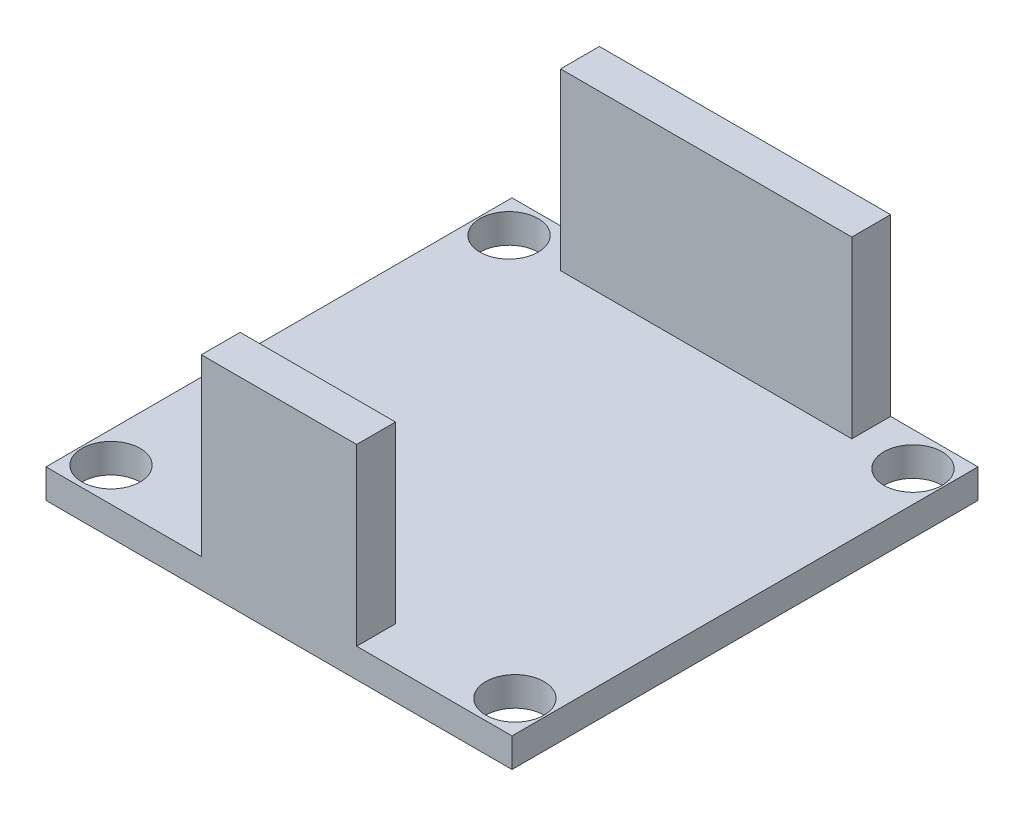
from build123d import *

# Parameters (mm, degrees)
SKETCH1_W           = 24
SKETCH1_H           = 24
BOSS_EXTRUDE1_DEPTH = 1.5
SKETCH2_R           = 1.5
CUT_EXTRUDE1_DEPTH  = 1.5
SKETCH3_W           = 4
SKETCH3_H           = 2
SKETCH3_W_2         = 7.5
BOSS_EXTRUDE2_DEPTH = 9


with BuildPart() as part:
    # Sketch1 → Boss-Extrude1 (new body)
    with BuildSketch(Plane(origin=(0, 0, 0), x_dir=(1, 0, 0), z_dir=(0, 1, 0))):
        with Locations((12, -12)):
            Rectangle(SKETCH1_W, SKETCH1_H)
    extrude(amount=BOSS_EXTRUDE1_DEPTH)

    # Sketch2 → Cut-Extrude1 (cut)
    with BuildSketch(Plane(origin=(0, 1.5, 0), x_dir=(1, 0, 0), z_dir=(0, 1, 0))):
        with Locations(Location((22.4, -1.75, 0), (0, 0, 270))):
            Circle(SKETCH2_R)
        with Locations(Location((22.4, -22.25, 0), (0, 0, 90))):
            Circle(SKETCH2_R)
        with Locations(Location((1.6, -22.25, 0), (0, 0, 270))):
            Circle(SKETCH2_R)
        with Locations(Location((1.6, -1.75, 0), (0, 0, 90))):
            Circle(SKETCH2_R)
    extrude(amount=-CUT_EXTRUDE1_DEPTH, mode=Mode.SUBTRACT)

    # Sketch3 → Boss-Extrude2 (add)
    with BuildSketch(Plane(origin=(0, 1.5, 0), x_dir=(1, 0, 0), z_dir=(0, 1, 0))):
        with Locations((10, -23)):
            Rectangle(SKETCH3_W, SKETCH3_H)
        with Locations((14, -23)):
            Rectangle(SKETCH3_W, SKETCH3_H)
        with Locations((15.75, -1)):
            Rectangle(SKETCH3_W_2, SKETCH3_H)
        with Locations((8.25, -1)):
            Rectangle(SKETCH3_W_2, SKETCH3_H)
    extrude(amount=BOSS_EXTRUDE2_DEPTH)


solid = part.part
